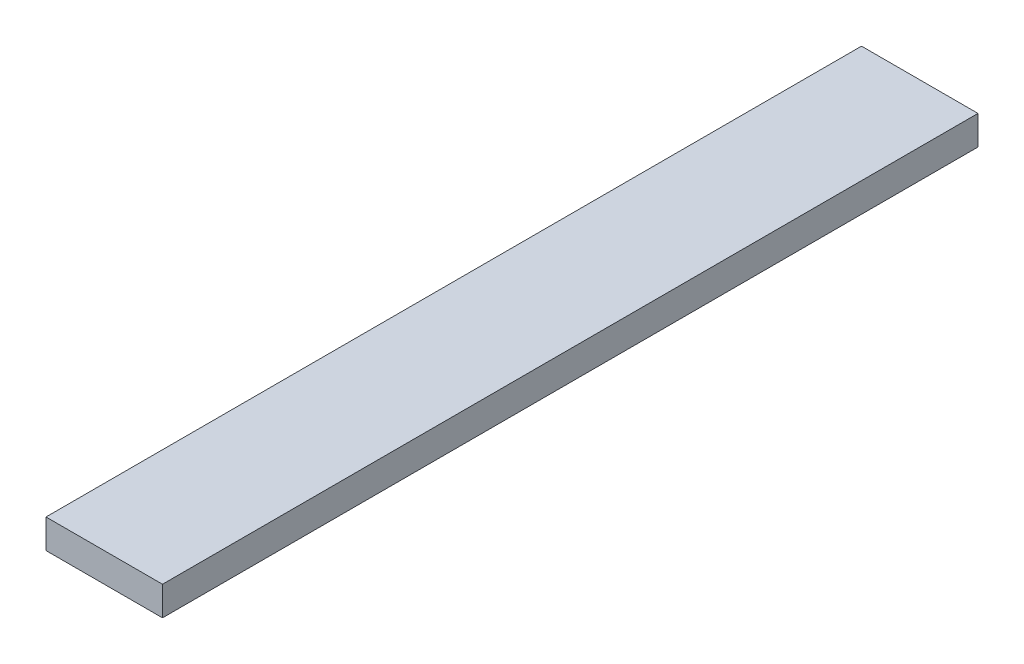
from build123d import *

# Parameters (mm, degrees)
ESQUISSE1_W      = 20
ESQUISSE1_H      = 5
EXTRUSION1_DEPTH = 140


with BuildPart() as part:
    # Esquisse1 → Extrusion1 (new body)
    with BuildSketch(Plane.XY):
        with Locations((10, 2.5)):
            Rectangle(ESQUISSE1_W, ESQUISSE1_H)
    extrude(amount=EXTRUSION1_DEPTH)


solid = part.part
